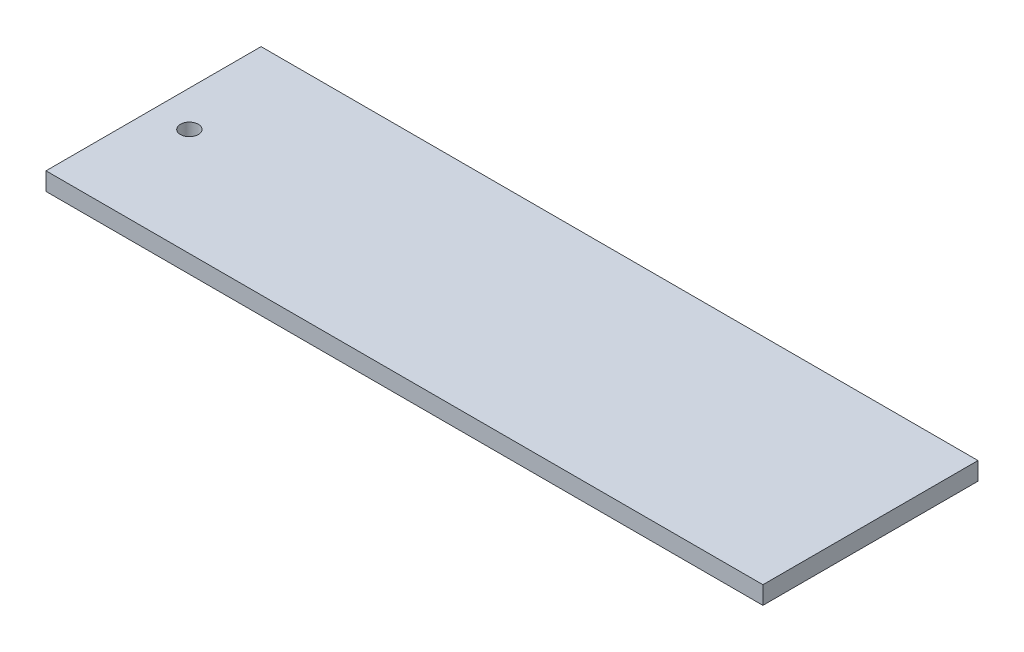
from build123d import *

# Parameters (mm, degrees)
SKETCH1_W      = 254
SKETCH1_H      = 76.2
SKETCH1_R      = 3.175
EXTRUDE1_DEPTH = 6.35


with BuildPart() as part:
    # Sketch1 → Extrude1 (new body)
    with BuildSketch(Plane(origin=(0, 0, 0), x_dir=(1, 0, 0), z_dir=(0, 1, 0))):
        with Locations((77.09209492, 0.701648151)):
            Rectangle(SKETCH1_W, SKETCH1_H)
        with Locations(Location((-37.20790508, 0.701648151, 0), (0, 0, 270))):
            Circle(SKETCH1_R, mode=Mode.SUBTRACT)
    extrude(amount=EXTRUDE1_DEPTH)


solid = part.part
